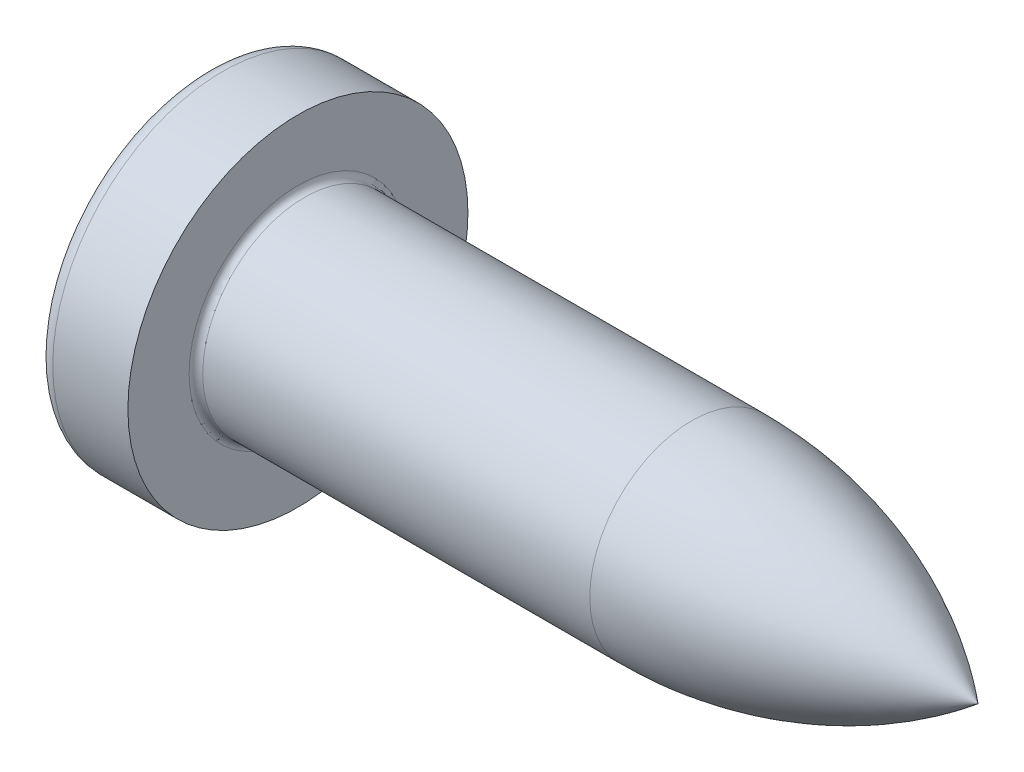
ISO-10303-21;
HEADER;
FILE_DESCRIPTION(('STEP AP214'),'2;1');
FILE_NAME('part.step','',(''),(''),'','','');
FILE_SCHEMA(('AUTOMOTIVE_DESIGN { 1 0 10303 214 1 1 1 1 }'));
ENDSEC;
DATA;
#1=APPLICATION_CONTEXT('core data for automotive mechanical design processes');
#2=APPLICATION_PROTOCOL_DEFINITION('international standard','automotive_design',2000,#1);
#3=PRODUCT_CONTEXT('',#1,'mechanical');
#4=PRODUCT('Part','Part','',(#3));
#5=PRODUCT_RELATED_PRODUCT_CATEGORY('part','',(#4));
#6=PRODUCT_DEFINITION_FORMATION('','',#4);
#7=PRODUCT_DEFINITION_CONTEXT('part definition',#1,'design');
#8=PRODUCT_DEFINITION('design','',#6,#7);
#9=PRODUCT_DEFINITION_SHAPE('','',#8);
#10=(LENGTH_UNIT() NAMED_UNIT(*) SI_UNIT(.MILLI.,.METRE.));
#11=(NAMED_UNIT(*) PLANE_ANGLE_UNIT() SI_UNIT($,.RADIAN.));
#12=(NAMED_UNIT(*) SI_UNIT($,.STERADIAN.) SOLID_ANGLE_UNIT());
#13=UNCERTAINTY_MEASURE_WITH_UNIT(LENGTH_MEASURE(1.E-05),#10,'distance_accuracy_value','');
#14=(GEOMETRIC_REPRESENTATION_CONTEXT(3) GLOBAL_UNCERTAINTY_ASSIGNED_CONTEXT((#13)) GLOBAL_UNIT_ASSIGNED_CONTEXT((#10,
#11,#12)) REPRESENTATION_CONTEXT('',''));
#15=CARTESIAN_POINT('',(0.,0.,0.));
#16=DIRECTION('',(0.,0.,1.));
#17=DIRECTION('',(1.,0.,0.));
#18=AXIS2_PLACEMENT_3D('',#15,#16,#17);
#19=CARTESIAN_POINT('',(4.,0.,0.));
#20=DIRECTION('',(-1.,0.,0.));
#21=DIRECTION('',(0.,1.,0.));
#22=AXIS2_PLACEMENT_3D('',#19,#20,#21);
#23=SPHERICAL_SURFACE('',#22,4.);
#24=CARTESIAN_POINT('',(0.803195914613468,0.,0.));
#25=DIRECTION('',(-1.,0.,0.));
#26=DIRECTION('',(0.,0.,1.));
#27=AXIS2_PLACEMENT_3D('',#24,#25,#26);
#28=CIRCLE('',#27,2.40425531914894);
#29=CARTESIAN_POINT('',(0.803195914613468,0.,2.40425531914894));
#30=VERTEX_POINT('',#29);
#31=EDGE_CURVE('E230',#30,#30,#28,.T.);
#32=ORIENTED_EDGE('',*,*,#31,.T.);
#33=EDGE_LOOP('',(#32));
#34=FACE_BOUND('',#33,.T.);
#35=CARTESIAN_POINT('',(0.0543400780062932,0.,0.));
#36=DIRECTION('',(1.,0.,0.));
#37=DIRECTION('',(0.,0.,-1.));
#38=AXIS2_PLACEMENT_3D('',#35,#36,#37);
#39=CIRCLE('',#38,0.657090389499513);
#40=CARTESIAN_POINT('',(0.0543400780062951,-0.369999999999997,-0.54301729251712));
#41=VERTEX_POINT('',#40);
#42=CARTESIAN_POINT('',(0.0543400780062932,-0.543017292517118,-0.37));
#43=VERTEX_POINT('',#42);
#44=EDGE_CURVE('E446',#41,#43,#39,.F.);
#45=ORIENTED_EDGE('',*,*,#44,.F.);
#46=CARTESIAN_POINT('',(4.,-0.37,0.));
#47=DIRECTION('',(0.,1.,0.));
#48=DIRECTION('',(0.,0.,1.));
#49=AXIS2_PLACEMENT_3D('',#46,#47,#48);
#50=CIRCLE('',#49,3.98285073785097);
#51=CARTESIAN_POINT('',(0.201999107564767,-0.369999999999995,-1.19928696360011));
#52=VERTEX_POINT('',#51);
#53=EDGE_CURVE('E277',#52,#41,#50,.T.);
#54=ORIENTED_EDGE('',*,*,#53,.F.);
#55=CARTESIAN_POINT('',(3.72274316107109,0.,0.556091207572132));
#56=DIRECTION('',(0.446197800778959,0.,-0.89493436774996));
#57=DIRECTION('',(-0.89493436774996,0.,-0.446197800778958));
#58=AXIS2_PLACEMENT_3D('',#55,#56,#57);
#59=CIRCLE('',#58,3.95144166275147);
#60=CARTESIAN_POINT('',(0.20199910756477,0.370000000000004,-1.19928696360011));
#61=VERTEX_POINT('',#60);
#62=EDGE_CURVE('E249',#52,#61,#59,.T.);
#63=ORIENTED_EDGE('',*,*,#62,.T.);
#64=CARTESIAN_POINT('',(4.,0.37,0.));
#65=DIRECTION('',(0.,-1.,0.));
#66=DIRECTION('',(0.,0.,-1.));
#67=AXIS2_PLACEMENT_3D('',#64,#65,#66);
#68=CIRCLE('',#67,3.98285073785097);
#69=CARTESIAN_POINT('',(0.0543400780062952,0.370000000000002,-0.543017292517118));
#70=VERTEX_POINT('',#69);
#71=EDGE_CURVE('E285',#70,#61,#68,.T.);
#72=ORIENTED_EDGE('',*,*,#71,.F.);
#73=CARTESIAN_POINT('',(0.0543400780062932,0.543017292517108,-0.37));
#74=VERTEX_POINT('',#73);
#75=EDGE_CURVE('E359',#74,#70,#39,.F.);
#76=ORIENTED_EDGE('',*,*,#75,.F.);
#77=CARTESIAN_POINT('',(4.,0.,-0.37));
#78=DIRECTION('',(0.,0.,1.));
#79=DIRECTION('',(0.,-1.,0.));
#80=AXIS2_PLACEMENT_3D('',#77,#78,#79);
#81=CIRCLE('',#80,3.98285073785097);
#82=CARTESIAN_POINT('',(0.201999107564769,1.19928696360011,-0.37));
#83=VERTEX_POINT('',#82);
#84=EDGE_CURVE('E243',#83,#74,#81,.T.);
#85=ORIENTED_EDGE('',*,*,#84,.F.);
#86=CARTESIAN_POINT('',(3.72274316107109,-0.556091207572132,0.));
#87=DIRECTION('',(0.446197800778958,0.89493436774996,0.));
#88=DIRECTION('',(-0.89493436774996,0.446197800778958,0.));
#89=AXIS2_PLACEMENT_3D('',#86,#87,#88);
#90=CIRCLE('',#89,3.95144166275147);
#91=CARTESIAN_POINT('',(0.201999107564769,1.19928696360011,0.369999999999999));
#92=VERTEX_POINT('',#91);
#93=EDGE_CURVE('E246',#83,#92,#90,.T.);
#94=ORIENTED_EDGE('',*,*,#93,.T.);
#95=CARTESIAN_POINT('',(4.,0.,0.37));
#96=DIRECTION('',(0.,0.,-1.));
#97=DIRECTION('',(0.,1.,0.));
#98=AXIS2_PLACEMENT_3D('',#95,#96,#97);
#99=CIRCLE('',#98,3.98285073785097);
#100=CARTESIAN_POINT('',(0.0543400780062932,0.543017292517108,0.37));
#101=VERTEX_POINT('',#100);
#102=EDGE_CURVE('E239',#101,#92,#99,.T.);
#103=ORIENTED_EDGE('',*,*,#102,.F.);
#104=CARTESIAN_POINT('',(0.0543400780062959,0.369999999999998,0.54301729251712));
#105=VERTEX_POINT('',#104);
#106=EDGE_CURVE('E392',#105,#101,#39,.F.);
#107=ORIENTED_EDGE('',*,*,#106,.F.);
#108=CARTESIAN_POINT('',(0.201999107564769,0.369999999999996,1.19928696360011));
#109=VERTEX_POINT('',#108);
#110=EDGE_CURVE('E259',#109,#105,#68,.T.);
#111=ORIENTED_EDGE('',*,*,#110,.F.);
#112=CARTESIAN_POINT('',(3.72274316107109,0.,-0.556091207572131));
#113=DIRECTION('',(0.446197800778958,0.,0.89493436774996));
#114=DIRECTION('',(0.89493436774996,0.,-0.446197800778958));
#115=AXIS2_PLACEMENT_3D('',#112,#113,#114);
#116=CIRCLE('',#115,3.95144166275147);
#117=CARTESIAN_POINT('',(0.201999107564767,-0.370000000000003,1.19928696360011));
#118=VERTEX_POINT('',#117);
#119=EDGE_CURVE('E39',#109,#118,#116,.T.);
#120=ORIENTED_EDGE('',*,*,#119,.T.);
#121=CARTESIAN_POINT('',(0.0543400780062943,-0.370000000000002,0.543017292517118));
#122=VERTEX_POINT('',#121);
#123=EDGE_CURVE('E256',#122,#118,#50,.T.);
#124=ORIENTED_EDGE('',*,*,#123,.F.);
#125=CARTESIAN_POINT('',(0.0543400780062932,-0.543017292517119,0.369999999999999));
#126=VERTEX_POINT('',#125);
#127=EDGE_CURVE('E431',#126,#122,#39,.F.);
#128=ORIENTED_EDGE('',*,*,#127,.F.);
#129=CARTESIAN_POINT('',(0.201999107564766,-1.19928696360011,0.369999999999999));
#130=VERTEX_POINT('',#129);
#131=EDGE_CURVE('E240',#130,#126,#99,.T.);
#132=ORIENTED_EDGE('',*,*,#131,.F.);
#133=CARTESIAN_POINT('',(3.72274316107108,0.556091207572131,0.));
#134=DIRECTION('',(0.446197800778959,-0.89493436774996,0.));
#135=DIRECTION('',(0.89493436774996,0.446197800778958,0.));
#136=AXIS2_PLACEMENT_3D('',#133,#134,#135);
#137=CIRCLE('',#136,3.95144166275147);
#138=CARTESIAN_POINT('',(0.201999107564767,-1.19928696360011,-0.37));
#139=VERTEX_POINT('',#138);
#140=EDGE_CURVE('E236',#130,#139,#137,.T.);
#141=ORIENTED_EDGE('',*,*,#140,.T.);
#142=EDGE_CURVE('E54',#43,#139,#81,.T.);
#143=ORIENTED_EDGE('',*,*,#142,.F.);
#144=EDGE_LOOP('',(#45,#54,#63,#72,#76,#85,#94,#103,#107,#111,#120,#124,#128,#132,#141,#143));
#145=FACE_BOUND('',#144,.T.);
#146=ADVANCED_FACE('F26',(#34,#145),#23,.T.);
#147=CARTESIAN_POINT('',(1.5,0.552127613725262,-0.37));
#148=DIRECTION('',(0.,0.,1.));
#149=DIRECTION('',(0.,-1.,0.));
#150=AXIS2_PLACEMENT_3D('',#147,#148,#149);
#151=PLANE('',#150);
#152=ORIENTED_EDGE('',*,*,#84,.T.);
#153=CARTESIAN_POINT('',(-0.984107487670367,0.628943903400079,-0.37));
#154=CARTESIAN_POINT('',(-0.783603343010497,0.61266994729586,-0.37));
#155=CARTESIAN_POINT('',(-0.583110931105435,0.596248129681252,-0.37));
#156=CARTESIAN_POINT('',(-0.182155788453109,0.562989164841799,-0.37));
#157=CARTESIAN_POINT('',(0.018306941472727,0.546152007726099,-0.37));
#158=CARTESIAN_POINT('',(0.419186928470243,0.511943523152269,-0.37));
#159=CARTESIAN_POINT('',(0.619604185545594,0.494572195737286,-0.37));
#160=CARTESIAN_POINT('',(1.02037173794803,0.459102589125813,-0.37));
#161=CARTESIAN_POINT('',(1.2207220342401,0.441004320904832,-0.37));
#162=CARTESIAN_POINT('',(1.53631168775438,0.411665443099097,-0.37));
#163=CARTESIAN_POINT('',(1.65158348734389,0.400774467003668,-0.37));
#164=CARTESIAN_POINT('',(1.88208360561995,0.378547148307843,-0.37));
#165=CARTESIAN_POINT('',(1.99731192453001,0.367210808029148,-0.37));
#166=CARTESIAN_POINT('',(2.22771614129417,0.343963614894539,-0.37));
#167=CARTESIAN_POINT('',(2.34289203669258,0.332052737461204,-0.37));
#168=CARTESIAN_POINT('',(2.57315819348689,0.307413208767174,-0.37));
#169=CARTESIAN_POINT('',(2.68824845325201,0.294684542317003,-0.37));
#170=CARTESIAN_POINT('',(2.80327961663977,0.281425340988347,-0.37));
#171=B_SPLINE_CURVE_WITH_KNOTS('',3,(#153,#154,#155,#156,#157,#158,#159,#160,#161,#162,#163,
#164,#165,#166,#167,#168,#169,#170),.UNSPECIFIED.,.F.,.F.,(4,2,2,2,2,2,2,2,4),(0.,
0.603490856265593,1.20699609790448,1.81050129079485,2.41399737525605,2.76135214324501,
3.1087051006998,3.45607293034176,3.80344721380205),.UNSPECIFIED.);
#172=CARTESIAN_POINT('',(1.5,0.415013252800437,-0.370000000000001));
#173=VERTEX_POINT('',#172);
#174=EDGE_CURVE('E352',#74,#173,#171,.T.);
#175=ORIENTED_EDGE('',*,*,#174,.T.);
#176=DIRECTION('',(0.,1.,0.));
#177=VECTOR('',#176,1.);
#178=CARTESIAN_POINT('',(1.5,-0.552127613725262,-0.37));
#179=LINE('',#178,#177);
#180=CARTESIAN_POINT('',(1.5,0.552127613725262,-0.37));
#181=VERTEX_POINT('',#180);
#182=EDGE_CURVE('E302',#173,#181,#179,.T.);
#183=ORIENTED_EDGE('',*,*,#182,.T.);
#184=DIRECTION('',(0.89493436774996,-0.446197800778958,0.));
#185=VECTOR('',#184,1.);
#186=CARTESIAN_POINT('',(0.,1.3,-0.37));
#187=LINE('',#186,#185);
#188=EDGE_CURVE('E308',#83,#181,#187,.T.);
#189=ORIENTED_EDGE('',*,*,#188,.F.);
#190=EDGE_LOOP('',(#152,#175,#183,#189));
#191=FACE_BOUND('',#190,.T.);
#192=ADVANCED_FACE('F187',(#191),#151,.T.);
#193=CARTESIAN_POINT('',(1.5,-0.552127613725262,-0.37));
#194=VERTEX_POINT('',#193);
#195=CARTESIAN_POINT('',(1.5,-0.415013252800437,-0.370000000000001));
#196=VERTEX_POINT('',#195);
#197=EDGE_CURVE('E299',#194,#196,#179,.T.);
#198=ORIENTED_EDGE('',*,*,#197,.T.);
#199=CARTESIAN_POINT('',(-0.984107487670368,-0.62894390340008,-0.37));
#200=CARTESIAN_POINT('',(-0.783603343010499,-0.61266994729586,-0.37));
#201=CARTESIAN_POINT('',(-0.583110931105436,-0.596248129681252,-0.37));
#202=CARTESIAN_POINT('',(-0.18215578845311,-0.562989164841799,-0.37));
#203=CARTESIAN_POINT('',(0.0183069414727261,-0.546152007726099,-0.37));
#204=CARTESIAN_POINT('',(0.419186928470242,-0.511943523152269,-0.37));
#205=CARTESIAN_POINT('',(0.619604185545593,-0.494572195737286,-0.37));
#206=CARTESIAN_POINT('',(1.02037173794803,-0.459102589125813,-0.37));
#207=CARTESIAN_POINT('',(1.22072203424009,-0.441004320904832,-0.37));
#208=CARTESIAN_POINT('',(1.53631168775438,-0.411665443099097,-0.37));
#209=CARTESIAN_POINT('',(1.65158348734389,-0.400774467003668,-0.37));
#210=CARTESIAN_POINT('',(1.88208360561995,-0.378547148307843,-0.37));
#211=CARTESIAN_POINT('',(1.99731192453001,-0.367210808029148,-0.37));
#212=CARTESIAN_POINT('',(2.22771614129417,-0.343963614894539,-0.37));
#213=CARTESIAN_POINT('',(2.34289203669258,-0.332052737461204,-0.37));
#214=CARTESIAN_POINT('',(2.57315819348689,-0.307413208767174,-0.37));
#215=CARTESIAN_POINT('',(2.68824845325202,-0.294684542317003,-0.37));
#216=CARTESIAN_POINT('',(2.80327961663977,-0.281425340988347,-0.37));
#217=B_SPLINE_CURVE_WITH_KNOTS('',3,(#199,#200,#201,#202,#203,#204,#205,#206,#207,#208,#209,
#210,#211,#212,#213,#214,#215,#216),.UNSPECIFIED.,.F.,.F.,(4,2,2,2,2,2,2,2,4),(0.,
0.603490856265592,1.20699609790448,1.81050129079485,2.41399737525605,2.76135214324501,
3.1087051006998,3.45607293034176,3.80344721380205),.UNSPECIFIED.);
#218=EDGE_CURVE('E345',#196,#43,#217,.F.);
#219=ORIENTED_EDGE('',*,*,#218,.T.);
#220=ORIENTED_EDGE('',*,*,#142,.T.);
#221=DIRECTION('',(0.89493436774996,0.446197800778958,0.));
#222=VECTOR('',#221,1.);
#223=CARTESIAN_POINT('',(0.,-1.3,-0.37));
#224=LINE('',#223,#222);
#225=EDGE_CURVE('E305',#139,#194,#224,.T.);
#226=ORIENTED_EDGE('',*,*,#225,.T.);
#227=EDGE_LOOP('',(#198,#219,#220,#226));
#228=FACE_BOUND('',#227,.T.);
#229=ADVANCED_FACE('F194',(#228),#151,.T.);
#230=CARTESIAN_POINT('',(1.5,-0.552127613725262,0.369999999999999));
#231=DIRECTION('',(0.,0.,-1.));
#232=DIRECTION('',(0.,1.,0.));
#233=AXIS2_PLACEMENT_3D('',#230,#231,#232);
#234=PLANE('',#233);
#235=DIRECTION('',(0.,-1.,0.));
#236=VECTOR('',#235,1.);
#237=CARTESIAN_POINT('',(1.5,0.552127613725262,0.37));
#238=LINE('',#237,#236);
#239=CARTESIAN_POINT('',(1.5,0.552127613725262,0.37));
#240=VERTEX_POINT('',#239);
#241=CARTESIAN_POINT('',(1.5,0.415013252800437,0.370000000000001));
#242=VERTEX_POINT('',#241);
#243=EDGE_CURVE('E291',#240,#242,#238,.T.);
#244=ORIENTED_EDGE('',*,*,#243,.T.);
#245=CARTESIAN_POINT('',(-0.984107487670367,0.62894390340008,0.37));
#246=CARTESIAN_POINT('',(-0.783603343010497,0.61266994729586,0.37));
#247=CARTESIAN_POINT('',(-0.583110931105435,0.596248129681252,0.37));
#248=CARTESIAN_POINT('',(-0.182155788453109,0.562989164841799,0.37));
#249=CARTESIAN_POINT('',(0.0183069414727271,0.546152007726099,0.37));
#250=CARTESIAN_POINT('',(0.419186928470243,0.511943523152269,0.37));
#251=CARTESIAN_POINT('',(0.619604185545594,0.494572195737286,0.37));
#252=CARTESIAN_POINT('',(1.02037173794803,0.459102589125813,0.37));
#253=CARTESIAN_POINT('',(1.2207220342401,0.441004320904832,0.37));
#254=CARTESIAN_POINT('',(1.53631168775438,0.411665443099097,0.37));
#255=CARTESIAN_POINT('',(1.65158348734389,0.400774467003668,0.37));
#256=CARTESIAN_POINT('',(1.88208360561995,0.378547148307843,0.37));
#257=CARTESIAN_POINT('',(1.99731192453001,0.367210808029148,0.37));
#258=CARTESIAN_POINT('',(2.22771614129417,0.343963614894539,0.37));
#259=CARTESIAN_POINT('',(2.34289203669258,0.332052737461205,0.37));
#260=CARTESIAN_POINT('',(2.57315819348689,0.307413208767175,0.37));
#261=CARTESIAN_POINT('',(2.68824845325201,0.294684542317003,0.37));
#262=CARTESIAN_POINT('',(2.80327961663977,0.281425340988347,0.37));
#263=B_SPLINE_CURVE_WITH_KNOTS('',3,(#245,#246,#247,#248,#249,#250,#251,#252,#253,#254,#255,
#256,#257,#258,#259,#260,#261,#262),.UNSPECIFIED.,.F.,.F.,(4,2,2,2,2,2,2,2,4),(0.,
0.603490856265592,1.20699609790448,1.81050129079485,2.41399737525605,2.76135214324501,
3.1087051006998,3.45607293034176,3.80344721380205),.UNSPECIFIED.);
#264=EDGE_CURVE('E393',#242,#101,#263,.F.);
#265=ORIENTED_EDGE('',*,*,#264,.T.);
#266=ORIENTED_EDGE('',*,*,#102,.T.);
#267=DIRECTION('',(0.89493436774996,-0.446197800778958,0.));
#268=VECTOR('',#267,1.);
#269=CARTESIAN_POINT('',(0.,1.3,0.37));
#270=LINE('',#269,#268);
#271=EDGE_CURVE('E307',#92,#240,#270,.T.);
#272=ORIENTED_EDGE('',*,*,#271,.T.);
#273=EDGE_LOOP('',(#244,#265,#266,#272));
#274=FACE_BOUND('',#273,.T.);
#275=ADVANCED_FACE('F340',(#274),#234,.T.);
#276=ORIENTED_EDGE('',*,*,#131,.T.);
#277=CARTESIAN_POINT('',(-0.984107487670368,-0.62894390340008,0.369999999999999));
#278=CARTESIAN_POINT('',(-0.783603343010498,-0.612669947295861,0.369999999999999));
#279=CARTESIAN_POINT('',(-0.583110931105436,-0.596248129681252,0.369999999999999));
#280=CARTESIAN_POINT('',(-0.18215578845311,-0.562989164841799,0.369999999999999));
#281=CARTESIAN_POINT('',(0.0183069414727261,-0.5461520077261,0.369999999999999));
#282=CARTESIAN_POINT('',(0.419186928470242,-0.511943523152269,0.369999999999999));
#283=CARTESIAN_POINT('',(0.619604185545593,-0.494572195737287,0.369999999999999));
#284=CARTESIAN_POINT('',(1.02037173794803,-0.459102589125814,0.369999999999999));
#285=CARTESIAN_POINT('',(1.22072203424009,-0.441004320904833,0.369999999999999));
#286=CARTESIAN_POINT('',(1.53631168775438,-0.411665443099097,0.369999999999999));
#287=CARTESIAN_POINT('',(1.65158348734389,-0.400774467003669,0.37));
#288=CARTESIAN_POINT('',(1.88208360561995,-0.378547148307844,0.37));
#289=CARTESIAN_POINT('',(1.99731192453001,-0.367210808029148,0.37));
#290=CARTESIAN_POINT('',(2.22771614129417,-0.34396361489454,0.37));
#291=CARTESIAN_POINT('',(2.34289203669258,-0.332052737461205,0.37));
#292=CARTESIAN_POINT('',(2.57315819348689,-0.307413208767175,0.37));
#293=CARTESIAN_POINT('',(2.68824845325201,-0.294684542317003,0.37));
#294=CARTESIAN_POINT('',(2.80327961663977,-0.281425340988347,0.37));
#295=B_SPLINE_CURVE_WITH_KNOTS('',3,(#277,#278,#279,#280,#281,#282,#283,#284,#285,#286,#287,
#288,#289,#290,#291,#292,#293,#294),.UNSPECIFIED.,.F.,.F.,(4,2,2,2,2,2,2,2,4),(0.,
0.603490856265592,1.20699609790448,1.81050129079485,2.41399737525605,2.76135214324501,
3.1087051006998,3.45607293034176,3.80344721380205),.UNSPECIFIED.);
#296=CARTESIAN_POINT('',(1.5,-0.415013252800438,0.37));
#297=VERTEX_POINT('',#296);
#298=EDGE_CURVE('E383',#126,#297,#295,.T.);
#299=ORIENTED_EDGE('',*,*,#298,.T.);
#300=CARTESIAN_POINT('',(1.5,-0.552127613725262,0.369999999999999));
#301=VERTEX_POINT('',#300);
#302=EDGE_CURVE('E294',#297,#301,#238,.T.);
#303=ORIENTED_EDGE('',*,*,#302,.T.);
#304=DIRECTION('',(0.89493436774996,0.446197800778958,0.));
#305=VECTOR('',#304,1.);
#306=CARTESIAN_POINT('',(0.,-1.3,0.369999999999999));
#307=LINE('',#306,#305);
#308=EDGE_CURVE('E289',#130,#301,#307,.T.);
#309=ORIENTED_EDGE('',*,*,#308,.F.);
#310=EDGE_LOOP('',(#276,#299,#303,#309));
#311=FACE_BOUND('',#310,.T.);
#312=ADVANCED_FACE('F336',(#311),#234,.T.);
#313=CARTESIAN_POINT('',(1.5,0.552127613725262,0.37));
#314=DIRECTION('',(0.446197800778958,0.89493436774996,0.));
#315=DIRECTION('',(-0.89493436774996,0.446197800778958,0.));
#316=AXIS2_PLACEMENT_3D('',#313,#314,#315);
#317=PLANE('',#316);
#318=CARTESIAN_POINT('',(2.47007520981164,0.0684659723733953,0.));
#319=DIRECTION('',(0.446197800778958,0.89493436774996,0.));
#320=DIRECTION('',(-0.89493436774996,0.446197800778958,0.));
#321=AXIS2_PLACEMENT_3D('',#318,#319,#320);
#322=ELLIPSE('',#321,1.09405678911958,0.483340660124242);
#323=CARTESIAN_POINT('',(1.5,0.552127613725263,0.0655064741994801));
#324=VERTEX_POINT('',#323);
#325=CARTESIAN_POINT('',(1.5,0.552127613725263,-0.0655064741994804));
#326=VERTEX_POINT('',#325);
#327=EDGE_CURVE('E423',#324,#326,#322,.F.);
#328=ORIENTED_EDGE('',*,*,#327,.F.);
#329=DIRECTION('',(0.,0.,-1.));
#330=VECTOR('',#329,1.);
#331=CARTESIAN_POINT('',(1.5,0.552127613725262,0.37));
#332=LINE('',#331,#330);
#333=EDGE_CURVE('E295',#240,#324,#332,.T.);
#334=ORIENTED_EDGE('',*,*,#333,.F.);
#335=ORIENTED_EDGE('',*,*,#271,.F.);
#336=ORIENTED_EDGE('',*,*,#93,.F.);
#337=ORIENTED_EDGE('',*,*,#188,.T.);
#338=EDGE_CURVE('E298',#326,#181,#332,.T.);
#339=ORIENTED_EDGE('',*,*,#338,.F.);
#340=EDGE_LOOP('',(#328,#334,#335,#336,#337,#339));
#341=FACE_BOUND('',#340,.T.);
#342=ADVANCED_FACE('F333',(#341),#317,.F.);
#343=CARTESIAN_POINT('',(0.,-1.3,-0.37));
#344=DIRECTION('',(0.446197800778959,-0.89493436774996,0.));
#345=DIRECTION('',(0.89493436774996,0.446197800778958,0.));
#346=AXIS2_PLACEMENT_3D('',#343,#344,#345);
#347=PLANE('',#346);
#348=CARTESIAN_POINT('',(2.47007520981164,-0.0684659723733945,0.));
#349=DIRECTION('',(0.446197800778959,-0.89493436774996,0.));
#350=DIRECTION('',(-0.89493436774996,-0.446197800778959,0.));
#351=AXIS2_PLACEMENT_3D('',#348,#349,#350);
#352=ELLIPSE('',#351,1.09405678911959,0.483340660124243);
#353=CARTESIAN_POINT('',(1.5,-0.552127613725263,-0.0655064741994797));
#354=VERTEX_POINT('',#353);
#355=CARTESIAN_POINT('',(1.5,-0.552127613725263,0.0655064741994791));
#356=VERTEX_POINT('',#355);
#357=EDGE_CURVE('E419',#354,#356,#352,.F.);
#358=ORIENTED_EDGE('',*,*,#357,.F.);
#359=DIRECTION('',(0.,0.,1.));
#360=VECTOR('',#359,1.);
#361=CARTESIAN_POINT('',(1.5,-0.552127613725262,-0.37));
#362=LINE('',#361,#360);
#363=EDGE_CURVE('E286',#194,#354,#362,.T.);
#364=ORIENTED_EDGE('',*,*,#363,.F.);
#365=ORIENTED_EDGE('',*,*,#225,.F.);
#366=ORIENTED_EDGE('',*,*,#140,.F.);
#367=ORIENTED_EDGE('',*,*,#308,.T.);
#368=EDGE_CURVE('E290',#356,#301,#362,.T.);
#369=ORIENTED_EDGE('',*,*,#368,.F.);
#370=EDGE_LOOP('',(#358,#364,#365,#366,#367,#369));
#371=FACE_BOUND('',#370,.T.);
#372=ADVANCED_FACE('F335',(#371),#347,.F.);
#373=CARTESIAN_POINT('',(1.5,0.552127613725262,-0.37));
#374=DIRECTION('',(-1.,0.,0.));
#375=DIRECTION('',(0.,0.,1.));
#376=AXIS2_PLACEMENT_3D('',#373,#374,#375);
#377=PLANE('',#376);
#378=DIRECTION('',(0.,1.,0.));
#379=VECTOR('',#378,1.);
#380=CARTESIAN_POINT('',(1.5,-0.370000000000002,0.55212761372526));
#381=LINE('',#380,#379);
#382=CARTESIAN_POINT('',(1.5,-0.370000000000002,0.55212761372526));
#383=VERTEX_POINT('',#382);
#384=CARTESIAN_POINT('',(1.5,-0.0655064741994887,0.552127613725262));
#385=VERTEX_POINT('',#384);
#386=EDGE_CURVE('E487',#383,#385,#381,.T.);
#387=ORIENTED_EDGE('',*,*,#386,.T.);
#388=CARTESIAN_POINT('',(1.5,0.,0.));
#389=DIRECTION('',(-1.,0.,0.));
#390=DIRECTION('',(0.,0.,1.));
#391=AXIS2_PLACEMENT_3D('',#388,#389,#390);
#392=CIRCLE('',#391,0.556);
#393=CARTESIAN_POINT('',(1.5,-0.370000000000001,0.415013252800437));
#394=VERTEX_POINT('',#393);
#395=EDGE_CURVE('E444',#394,#385,#392,.T.);
#396=ORIENTED_EDGE('',*,*,#395,.F.);
#397=DIRECTION('',(0.,0.,-1.));
#398=VECTOR('',#397,1.);
#399=CARTESIAN_POINT('',(1.5,-0.370000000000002,0.55212761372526));
#400=LINE('',#399,#398);
#401=EDGE_CURVE('E482',#383,#394,#400,.T.);
#402=ORIENTED_EDGE('',*,*,#401,.F.);
#403=EDGE_LOOP('',(#387,#396,#402));
#404=FACE_BOUND('',#403,.T.);
#405=ADVANCED_FACE('F408',(#404),#377,.T.);
#406=ORIENTED_EDGE('',*,*,#302,.F.);
#407=EDGE_CURVE('E439',#356,#297,#392,.T.);
#408=ORIENTED_EDGE('',*,*,#407,.F.);
#409=ORIENTED_EDGE('',*,*,#368,.T.);
#410=EDGE_LOOP('',(#406,#408,#409));
#411=FACE_BOUND('',#410,.T.);
#412=ADVANCED_FACE('F410',(#411),#377,.T.);
#413=ORIENTED_EDGE('',*,*,#363,.T.);
#414=EDGE_CURVE('E428',#196,#354,#392,.T.);
#415=ORIENTED_EDGE('',*,*,#414,.F.);
#416=ORIENTED_EDGE('',*,*,#197,.F.);
#417=EDGE_LOOP('',(#413,#415,#416));
#418=FACE_BOUND('',#417,.T.);
#419=ADVANCED_FACE('F426',(#418),#377,.T.);
#420=CARTESIAN_POINT('',(1.5,-0.369999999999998,-0.415013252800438));
#421=VERTEX_POINT('',#420);
#422=CARTESIAN_POINT('',(1.5,-0.369999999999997,-0.552127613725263));
#423=VERTEX_POINT('',#422);
#424=EDGE_CURVE('E476',#421,#423,#400,.T.);
#425=ORIENTED_EDGE('',*,*,#424,.F.);
#426=CARTESIAN_POINT('',(1.5,-0.0655064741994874,-0.552127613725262));
#427=VERTEX_POINT('',#426);
#428=EDGE_CURVE('E46',#427,#421,#392,.T.);
#429=ORIENTED_EDGE('',*,*,#428,.F.);
#430=DIRECTION('',(0.,-1.,0.));
#431=VECTOR('',#430,1.);
#432=CARTESIAN_POINT('',(1.5,0.370000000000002,-0.55212761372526));
#433=LINE('',#432,#431);
#434=EDGE_CURVE('E474',#427,#423,#433,.T.);
#435=ORIENTED_EDGE('',*,*,#434,.T.);
#436=EDGE_LOOP('',(#425,#429,#435));
#437=FACE_BOUND('',#436,.T.);
#438=ADVANCED_FACE('F473',(#437),#377,.T.);
#439=CARTESIAN_POINT('',(1.5,0.370000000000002,-0.55212761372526));
#440=VERTEX_POINT('',#439);
#441=CARTESIAN_POINT('',(1.5,0.0655064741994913,-0.552127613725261));
#442=VERTEX_POINT('',#441);
#443=EDGE_CURVE('E481',#440,#442,#433,.T.);
#444=ORIENTED_EDGE('',*,*,#443,.T.);
#445=CARTESIAN_POINT('',(1.5,0.370000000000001,-0.415013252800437));
#446=VERTEX_POINT('',#445);
#447=EDGE_CURVE('E470',#446,#442,#392,.T.);
#448=ORIENTED_EDGE('',*,*,#447,.F.);
#449=DIRECTION('',(0.,0.,1.));
#450=VECTOR('',#449,1.);
#451=CARTESIAN_POINT('',(1.5,0.370000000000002,-0.55212761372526));
#452=LINE('',#451,#450);
#453=EDGE_CURVE('E491',#440,#446,#452,.T.);
#454=ORIENTED_EDGE('',*,*,#453,.F.);
#455=EDGE_LOOP('',(#444,#448,#454));
#456=FACE_BOUND('',#455,.T.);
#457=ADVANCED_FACE('F498',(#456),#377,.T.);
#458=ORIENTED_EDGE('',*,*,#182,.F.);
#459=EDGE_CURVE('E500',#326,#173,#392,.T.);
#460=ORIENTED_EDGE('',*,*,#459,.F.);
#461=ORIENTED_EDGE('',*,*,#338,.T.);
#462=EDGE_LOOP('',(#458,#460,#461));
#463=FACE_BOUND('',#462,.T.);
#464=ADVANCED_FACE('F526',(#463),#377,.T.);
#465=ORIENTED_EDGE('',*,*,#333,.T.);
#466=EDGE_CURVE('E505',#242,#324,#392,.T.);
#467=ORIENTED_EDGE('',*,*,#466,.F.);
#468=ORIENTED_EDGE('',*,*,#243,.F.);
#469=EDGE_LOOP('',(#465,#467,#468));
#470=FACE_BOUND('',#469,.T.);
#471=ADVANCED_FACE('F514',(#470),#377,.T.);
#472=CARTESIAN_POINT('',(1.5,0.369999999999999,0.415013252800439));
#473=VERTEX_POINT('',#472);
#474=CARTESIAN_POINT('',(1.5,0.369999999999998,0.552127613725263));
#475=VERTEX_POINT('',#474);
#476=EDGE_CURVE('E274',#473,#475,#452,.T.);
#477=ORIENTED_EDGE('',*,*,#476,.F.);
#478=CARTESIAN_POINT('',(1.5,0.0655064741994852,0.552127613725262));
#479=VERTEX_POINT('',#478);
#480=EDGE_CURVE('E445',#479,#473,#392,.T.);
#481=ORIENTED_EDGE('',*,*,#480,.F.);
#482=EDGE_CURVE('E490',#479,#475,#381,.T.);
#483=ORIENTED_EDGE('',*,*,#482,.T.);
#484=EDGE_LOOP('',(#477,#481,#483));
#485=FACE_BOUND('',#484,.T.);
#486=ADVANCED_FACE('F402',(#485),#377,.T.);
#487=CARTESIAN_POINT('',(1.5,0.369999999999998,0.552127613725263));
#488=DIRECTION('',(0.,-1.,0.));
#489=DIRECTION('',(0.,0.,-1.));
#490=AXIS2_PLACEMENT_3D('',#487,#488,#489);
#491=PLANE('',#490);
#492=ORIENTED_EDGE('',*,*,#110,.T.);
#493=CARTESIAN_POINT('',(-0.984107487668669,0.369999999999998,0.628943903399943));
#494=CARTESIAN_POINT('',(-0.783603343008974,0.369999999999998,0.612669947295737));
#495=CARTESIAN_POINT('',(-0.583110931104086,0.369999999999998,0.596248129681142));
#496=CARTESIAN_POINT('',(-0.182155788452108,0.369999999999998,0.562989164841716));
#497=CARTESIAN_POINT('',(0.0183069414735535,0.369999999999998,0.546152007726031));
#498=CARTESIAN_POINT('',(0.419186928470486,0.369999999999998,0.511943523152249));
#499=CARTESIAN_POINT('',(0.61960418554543,0.369999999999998,0.494572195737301));
#500=CARTESIAN_POINT('',(1.02037173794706,0.369999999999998,0.459102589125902));
#501=CARTESIAN_POINT('',(1.22072203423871,0.369999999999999,0.441004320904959));
#502=CARTESIAN_POINT('',(1.53631168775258,0.369999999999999,0.411665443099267));
#503=CARTESIAN_POINT('',(1.65158348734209,0.369999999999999,0.40077446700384));
#504=CARTESIAN_POINT('',(1.88208360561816,0.369999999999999,0.378547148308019));
#505=CARTESIAN_POINT('',(1.99731192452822,0.369999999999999,0.367210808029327));
#506=CARTESIAN_POINT('',(2.22771614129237,0.369999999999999,0.343963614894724));
#507=CARTESIAN_POINT('',(2.34289203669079,0.369999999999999,0.332052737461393));
#508=CARTESIAN_POINT('',(2.5731581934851,0.369999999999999,0.307413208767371));
#509=CARTESIAN_POINT('',(2.68824845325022,0.369999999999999,0.294684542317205));
#510=CARTESIAN_POINT('',(2.80327961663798,0.369999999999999,0.281425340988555));
#511=B_SPLINE_CURVE_WITH_KNOTS('',3,(#493,#494,#495,#496,#497,#498,#499,#500,#501,#502,#503,
#504,#505,#506,#507,#508,#509,#510),.UNSPECIFIED.,.F.,.F.,(4,2,2,2,2,2,2,2,4),(0.,
0.603490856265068,1.20699609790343,1.81050129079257,2.41399737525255,2.7613521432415,
3.1087051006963,3.45607293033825,3.80344721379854),.UNSPECIFIED.);
#512=EDGE_CURVE('E388',#105,#473,#511,.T.);
#513=ORIENTED_EDGE('',*,*,#512,.T.);
#514=ORIENTED_EDGE('',*,*,#476,.T.);
#515=DIRECTION('',(0.89493436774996,0.,-0.446197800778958));
#516=VECTOR('',#515,1.);
#517=CARTESIAN_POINT('',(0.,0.369999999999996,1.3));
#518=LINE('',#517,#516);
#519=EDGE_CURVE('E267',#109,#475,#518,.T.);
#520=ORIENTED_EDGE('',*,*,#519,.F.);
#521=EDGE_LOOP('',(#492,#513,#514,#520));
#522=FACE_BOUND('',#521,.T.);
#523=ADVANCED_FACE('F271',(#522),#491,.T.);
#524=CARTESIAN_POINT('',(1.5,-0.369999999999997,-0.552127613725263));
#525=DIRECTION('',(0.,1.,0.));
#526=DIRECTION('',(0.,0.,1.));
#527=AXIS2_PLACEMENT_3D('',#524,#525,#526);
#528=PLANE('',#527);
#529=ORIENTED_EDGE('',*,*,#401,.T.);
#530=CARTESIAN_POINT('',(-0.984107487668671,-0.370000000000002,0.628943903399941));
#531=CARTESIAN_POINT('',(-0.783603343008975,-0.370000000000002,0.612669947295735));
#532=CARTESIAN_POINT('',(-0.583110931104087,-0.370000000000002,0.59624812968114));
#533=CARTESIAN_POINT('',(-0.18215578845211,-0.370000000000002,0.562989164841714));
#534=CARTESIAN_POINT('',(0.0183069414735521,-0.370000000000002,0.546152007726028));
#535=CARTESIAN_POINT('',(0.419186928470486,-0.370000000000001,0.511943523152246));
#536=CARTESIAN_POINT('',(0.619604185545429,-0.370000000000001,0.494572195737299));
#537=CARTESIAN_POINT('',(1.02037173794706,-0.370000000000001,0.459102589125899));
#538=CARTESIAN_POINT('',(1.22072203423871,-0.370000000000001,0.441004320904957));
#539=CARTESIAN_POINT('',(1.53631168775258,-0.370000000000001,0.411665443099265));
#540=CARTESIAN_POINT('',(1.65158348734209,-0.370000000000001,0.400774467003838));
#541=CARTESIAN_POINT('',(1.88208360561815,-0.370000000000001,0.378547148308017));
#542=CARTESIAN_POINT('',(1.99731192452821,-0.370000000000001,0.367210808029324));
#543=CARTESIAN_POINT('',(2.22771614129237,-0.370000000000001,0.343963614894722));
#544=CARTESIAN_POINT('',(2.34289203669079,-0.370000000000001,0.332052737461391));
#545=CARTESIAN_POINT('',(2.5731581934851,-0.370000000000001,0.307413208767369));
#546=CARTESIAN_POINT('',(2.68824845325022,-0.370000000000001,0.294684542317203));
#547=CARTESIAN_POINT('',(2.80327961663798,-0.370000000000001,0.281425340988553));
#548=B_SPLINE_CURVE_WITH_KNOTS('',3,(#530,#531,#532,#533,#534,#535,#536,#537,#538,#539,#540,
#541,#542,#543,#544,#545,#546,#547),.UNSPECIFIED.,.F.,.F.,(4,2,2,2,2,2,2,2,4),(0.,
0.603490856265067,1.20699609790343,1.81050129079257,2.41399737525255,2.7613521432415,
3.1087051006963,3.45607293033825,3.80344721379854),.UNSPECIFIED.);
#549=EDGE_CURVE('E378',#394,#122,#548,.F.);
#550=ORIENTED_EDGE('',*,*,#549,.T.);
#551=ORIENTED_EDGE('',*,*,#123,.T.);
#552=DIRECTION('',(0.89493436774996,0.,-0.446197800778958));
#553=VECTOR('',#552,1.);
#554=CARTESIAN_POINT('',(0.,-0.370000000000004,1.3));
#555=LINE('',#554,#553);
#556=EDGE_CURVE('E269',#118,#383,#555,.T.);
#557=ORIENTED_EDGE('',*,*,#556,.T.);
#558=EDGE_LOOP('',(#529,#550,#551,#557));
#559=FACE_BOUND('',#558,.T.);
#560=ADVANCED_FACE('F401',(#559),#528,.T.);
#561=CARTESIAN_POINT('',(1.5,-0.370000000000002,0.55212761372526));
#562=DIRECTION('',(0.446197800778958,0.,0.89493436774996));
#563=DIRECTION('',(-0.89493436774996,0.,0.446197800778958));
#564=AXIS2_PLACEMENT_3D('',#561,#562,#563);
#565=PLANE('',#564);
#566=CARTESIAN_POINT('',(2.47007520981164,0.,0.0684659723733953));
#567=DIRECTION('',(0.446197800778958,0.,0.89493436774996));
#568=DIRECTION('',(-0.89493436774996,0.,0.446197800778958));
#569=AXIS2_PLACEMENT_3D('',#566,#567,#568);
#570=ELLIPSE('',#569,1.09405678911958,0.483340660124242);
#571=EDGE_CURVE('E454',#385,#479,#570,.F.);
#572=ORIENTED_EDGE('',*,*,#571,.F.);
#573=ORIENTED_EDGE('',*,*,#386,.F.);
#574=ORIENTED_EDGE('',*,*,#556,.F.);
#575=ORIENTED_EDGE('',*,*,#119,.F.);
#576=ORIENTED_EDGE('',*,*,#519,.T.);
#577=ORIENTED_EDGE('',*,*,#482,.F.);
#578=EDGE_LOOP('',(#572,#573,#574,#575,#576,#577));
#579=FACE_BOUND('',#578,.T.);
#580=ADVANCED_FACE('F265',(#579),#565,.F.);
#581=CARTESIAN_POINT('',(0.,0.370000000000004,-1.3));
#582=DIRECTION('',(0.446197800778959,0.,-0.89493436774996));
#583=DIRECTION('',(0.89493436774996,0.,0.446197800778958));
#584=AXIS2_PLACEMENT_3D('',#581,#582,#583);
#585=PLANE('',#584);
#586=CARTESIAN_POINT('',(2.47007520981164,0.,-0.0684659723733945));
#587=DIRECTION('',(0.446197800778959,0.,-0.89493436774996));
#588=DIRECTION('',(-0.89493436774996,0.,-0.446197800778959));
#589=AXIS2_PLACEMENT_3D('',#586,#587,#588);
#590=ELLIPSE('',#589,1.09405678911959,0.483340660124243);
#591=EDGE_CURVE('E358',#442,#427,#590,.F.);
#592=ORIENTED_EDGE('',*,*,#591,.F.);
#593=ORIENTED_EDGE('',*,*,#443,.F.);
#594=DIRECTION('',(0.89493436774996,0.,0.446197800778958));
#595=VECTOR('',#594,1.);
#596=CARTESIAN_POINT('',(0.,0.370000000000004,-1.3));
#597=LINE('',#596,#595);
#598=EDGE_CURVE('E279',#61,#440,#597,.T.);
#599=ORIENTED_EDGE('',*,*,#598,.F.);
#600=ORIENTED_EDGE('',*,*,#62,.F.);
#601=DIRECTION('',(0.89493436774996,0.,0.446197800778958));
#602=VECTOR('',#601,1.);
#603=CARTESIAN_POINT('',(0.,-0.369999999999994,-1.3));
#604=LINE('',#603,#602);
#605=EDGE_CURVE('E480',#52,#423,#604,.T.);
#606=ORIENTED_EDGE('',*,*,#605,.T.);
#607=ORIENTED_EDGE('',*,*,#434,.F.);
#608=EDGE_LOOP('',(#592,#593,#599,#600,#606,#607));
#609=FACE_BOUND('',#608,.T.);
#610=ADVANCED_FACE('F368',(#609),#585,.F.);
#611=ORIENTED_EDGE('',*,*,#453,.T.);
#612=CARTESIAN_POINT('',(-0.98410748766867,0.370000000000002,-0.628943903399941));
#613=CARTESIAN_POINT('',(-0.783603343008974,0.370000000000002,-0.612669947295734));
#614=CARTESIAN_POINT('',(-0.583110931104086,0.370000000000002,-0.59624812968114));
#615=CARTESIAN_POINT('',(-0.182155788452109,0.370000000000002,-0.562989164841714));
#616=CARTESIAN_POINT('',(0.0183069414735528,0.370000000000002,-0.546152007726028));
#617=CARTESIAN_POINT('',(0.419186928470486,0.370000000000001,-0.511943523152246));
#618=CARTESIAN_POINT('',(0.61960418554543,0.370000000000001,-0.494572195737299));
#619=CARTESIAN_POINT('',(1.02037173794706,0.370000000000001,-0.459102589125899));
#620=CARTESIAN_POINT('',(1.22072203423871,0.370000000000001,-0.441004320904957));
#621=CARTESIAN_POINT('',(1.53631168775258,0.370000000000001,-0.411665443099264));
#622=CARTESIAN_POINT('',(1.65158348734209,0.370000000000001,-0.400774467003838));
#623=CARTESIAN_POINT('',(1.88208360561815,0.370000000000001,-0.378547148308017));
#624=CARTESIAN_POINT('',(1.99731192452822,0.370000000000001,-0.367210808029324));
#625=CARTESIAN_POINT('',(2.22771614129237,0.370000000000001,-0.343963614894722));
#626=CARTESIAN_POINT('',(2.34289203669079,0.370000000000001,-0.332052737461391));
#627=CARTESIAN_POINT('',(2.5731581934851,0.370000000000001,-0.307413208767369));
#628=CARTESIAN_POINT('',(2.68824845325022,0.370000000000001,-0.294684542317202));
#629=CARTESIAN_POINT('',(2.80327961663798,0.370000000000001,-0.281425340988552));
#630=B_SPLINE_CURVE_WITH_KNOTS('',3,(#612,#613,#614,#615,#616,#617,#618,#619,#620,#621,#622,
#623,#624,#625,#626,#627,#628,#629),.UNSPECIFIED.,.F.,.F.,(4,2,2,2,2,2,2,2,4),(0.,
0.603490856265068,1.20699609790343,1.81050129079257,2.41399737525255,2.7613521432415,
3.1087051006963,3.45607293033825,3.80344721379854),.UNSPECIFIED.);
#631=EDGE_CURVE('E360',#446,#70,#630,.F.);
#632=ORIENTED_EDGE('',*,*,#631,.T.);
#633=ORIENTED_EDGE('',*,*,#71,.T.);
#634=ORIENTED_EDGE('',*,*,#598,.T.);
#635=EDGE_LOOP('',(#611,#632,#633,#634));
#636=FACE_BOUND('',#635,.T.);
#637=ADVANCED_FACE('F403',(#636),#491,.T.);
#638=ORIENTED_EDGE('',*,*,#53,.T.);
#639=CARTESIAN_POINT('',(-0.98410748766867,-0.369999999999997,-0.628943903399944));
#640=CARTESIAN_POINT('',(-0.783603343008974,-0.369999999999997,-0.612669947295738));
#641=CARTESIAN_POINT('',(-0.583110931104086,-0.369999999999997,-0.596248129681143));
#642=CARTESIAN_POINT('',(-0.182155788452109,-0.369999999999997,-0.562989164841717));
#643=CARTESIAN_POINT('',(0.0183069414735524,-0.369999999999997,-0.546152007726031));
#644=CARTESIAN_POINT('',(0.419186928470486,-0.369999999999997,-0.511943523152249));
#645=CARTESIAN_POINT('',(0.619604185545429,-0.369999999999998,-0.494572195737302));
#646=CARTESIAN_POINT('',(1.02037173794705,-0.369999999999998,-0.459102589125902));
#647=CARTESIAN_POINT('',(1.22072203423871,-0.369999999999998,-0.44100432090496));
#648=CARTESIAN_POINT('',(1.53631168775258,-0.369999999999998,-0.411665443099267));
#649=CARTESIAN_POINT('',(1.65158348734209,-0.369999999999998,-0.400774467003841));
#650=CARTESIAN_POINT('',(1.88208360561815,-0.369999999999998,-0.37854714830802));
#651=CARTESIAN_POINT('',(1.99731192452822,-0.369999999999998,-0.367210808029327));
#652=CARTESIAN_POINT('',(2.22771614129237,-0.369999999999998,-0.343963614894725));
#653=CARTESIAN_POINT('',(2.34289203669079,-0.369999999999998,-0.332052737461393));
#654=CARTESIAN_POINT('',(2.5731581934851,-0.369999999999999,-0.307413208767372));
#655=CARTESIAN_POINT('',(2.68824845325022,-0.369999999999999,-0.294684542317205));
#656=CARTESIAN_POINT('',(2.80327961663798,-0.369999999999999,-0.281425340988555));
#657=B_SPLINE_CURVE_WITH_KNOTS('',3,(#639,#640,#641,#642,#643,#644,#645,#646,#647,#648,#649,
#650,#651,#652,#653,#654,#655,#656),.UNSPECIFIED.,.F.,.F.,(4,2,2,2,2,2,2,2,4),(0.,
0.603490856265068,1.20699609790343,1.81050129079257,2.41399737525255,2.7613521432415,
3.1087051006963,3.45607293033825,3.80344721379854),.UNSPECIFIED.);
#658=EDGE_CURVE('E11',#41,#421,#657,.T.);
#659=ORIENTED_EDGE('',*,*,#658,.T.);
#660=ORIENTED_EDGE('',*,*,#424,.T.);
#661=ORIENTED_EDGE('',*,*,#605,.F.);
#662=EDGE_LOOP('',(#638,#659,#660,#661));
#663=FACE_BOUND('',#662,.T.);
#664=ADVANCED_FACE('F216',(#663),#528,.T.);
#665=CARTESIAN_POINT('',(-25.4,0.,0.));
#666=DIRECTION('',(-1.,0.,0.));
#667=DIRECTION('',(0.,0.,1.));
#668=AXIS2_PLACEMENT_3D('',#665,#666,#667);
#669=CYLINDRICAL_SURFACE('',#668,1.5);
#670=CARTESIAN_POINT('',(2.2,0.,0.));
#671=DIRECTION('',(-1.,0.,0.));
#672=DIRECTION('',(0.,0.,1.));
#673=AXIS2_PLACEMENT_3D('',#670,#671,#672);
#674=CIRCLE('',#673,1.5);
#675=CARTESIAN_POINT('',(2.2,0.,1.5));
#676=VERTEX_POINT('',#675);
#677=EDGE_CURVE('E227',#676,#676,#674,.F.);
#678=ORIENTED_EDGE('',*,*,#677,.T.);
#679=EDGE_LOOP('',(#678));
#680=FACE_BOUND('',#679,.T.);
#681=CARTESIAN_POINT('',(7.89130777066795,0.,0.));
#682=DIRECTION('',(-1.,0.,0.));
#683=DIRECTION('',(0.,0.,1.));
#684=AXIS2_PLACEMENT_3D('',#681,#682,#683);
#685=CIRCLE('',#684,1.5);
#686=CARTESIAN_POINT('',(7.89130777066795,0.,1.5));
#687=VERTEX_POINT('',#686);
#688=EDGE_CURVE('E311',#687,#687,#685,.T.);
#689=ORIENTED_EDGE('',*,*,#688,.T.);
#690=EDGE_LOOP('',(#689));
#691=FACE_BOUND('',#690,.T.);
#692=ADVANCED_FACE('F28',(#680,#691),#669,.T.);
#693=CARTESIAN_POINT('',(2.1,1.5,0.));
#694=DIRECTION('',(-1.,0.,0.));
#695=DIRECTION('',(0.,0.,1.));
#696=AXIS2_PLACEMENT_3D('',#693,#694,#695);
#697=PLANE('',#696);
#698=CARTESIAN_POINT('',(2.1,0.,0.));
#699=DIRECTION('',(-1.,0.,0.));
#700=DIRECTION('',(0.,0.,1.));
#701=AXIS2_PLACEMENT_3D('',#698,#699,#700);
#702=CIRCLE('',#701,1.6);
#703=CARTESIAN_POINT('',(2.1,0.,1.6));
#704=VERTEX_POINT('',#703);
#705=EDGE_CURVE('E221',#704,#704,#702,.T.);
#706=ORIENTED_EDGE('',*,*,#705,.T.);
#707=EDGE_LOOP('',(#706));
#708=FACE_BOUND('',#707,.T.);
#709=CARTESIAN_POINT('',(2.1,0.,0.));
#710=DIRECTION('',(-1.,0.,0.));
#711=DIRECTION('',(0.,0.,1.));
#712=AXIS2_PLACEMENT_3D('',#709,#710,#711);
#713=CIRCLE('',#712,2.5);
#714=CARTESIAN_POINT('',(2.1,0.,2.5));
#715=VERTEX_POINT('',#714);
#716=EDGE_CURVE('E224',#715,#715,#713,.T.);
#717=ORIENTED_EDGE('',*,*,#716,.F.);
#718=EDGE_LOOP('',(#717));
#719=FACE_BOUND('',#718,.T.);
#720=ADVANCED_FACE('F209',(#708,#719),#697,.F.);
#721=CARTESIAN_POINT('',(-25.4,0.,0.));
#722=DIRECTION('',(-1.,0.,0.));
#723=DIRECTION('',(0.,0.,1.));
#724=AXIS2_PLACEMENT_3D('',#721,#722,#723);
#725=CYLINDRICAL_SURFACE('',#724,2.5);
#726=ORIENTED_EDGE('',*,*,#716,.T.);
#727=EDGE_LOOP('',(#726));
#728=FACE_BOUND('',#727,.T.);
#729=CARTESIAN_POINT('',(0.995004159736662,0.,0.));
#730=DIRECTION('',(-1.,0.,0.));
#731=DIRECTION('',(0.,0.,1.));
#732=AXIS2_PLACEMENT_3D('',#729,#730,#731);
#733=CIRCLE('',#732,2.5);
#734=CARTESIAN_POINT('',(0.995004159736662,0.,2.5));
#735=VERTEX_POINT('',#734);
#736=EDGE_CURVE('E225',#735,#735,#733,.T.);
#737=ORIENTED_EDGE('',*,*,#736,.F.);
#738=EDGE_LOOP('',(#737));
#739=FACE_BOUND('',#738,.T.);
#740=ADVANCED_FACE('F206',(#728,#739),#725,.T.);
#741=CARTESIAN_POINT('',(0.995004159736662,0.,0.));
#742=DIRECTION('',(-1.,0.,0.));
#743=DIRECTION('',(0.,0.,1.));
#744=AXIS2_PLACEMENT_3D('',#741,#742,#743);
#745=TOROIDAL_SURFACE('',#744,2.26,0.24);
#746=ORIENTED_EDGE('',*,*,#736,.T.);
#747=EDGE_LOOP('',(#746));
#748=FACE_BOUND('',#747,.T.);
#749=ORIENTED_EDGE('',*,*,#31,.F.);
#750=EDGE_LOOP('',(#749));
#751=FACE_BOUND('',#750,.T.);
#752=ADVANCED_FACE('F203',(#748,#751),#745,.T.);
#753=CARTESIAN_POINT('',(7.89130777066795,0.,-5.15436342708));
#754=DIRECTION('',(0.,-1.,0.));
#755=DIRECTION('',(0.,0.,1.));
#756=AXIS2_PLACEMENT_3D('',#753,#754,#755);
#757=CIRCLE('',#756,6.65436342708);
#758=TRIMMED_CURVE('',#757,(PARAMETER_VALUE(-0.684739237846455)),
(PARAMETER_VALUE(0.684739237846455)),.T.,.PARAMETER.);
#759=CARTESIAN_POINT('',(7.89130777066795,0.,0.));
#760=DIRECTION('',(-1.,0.,0.));
#761=AXIS1_PLACEMENT('',#759,#760);
#762=SURFACE_OF_REVOLUTION('',#758,#761);
#763=ORIENTED_EDGE('',*,*,#688,.F.);
#764=EDGE_LOOP('',(#763));
#765=FACE_BOUND('',#764,.T.);
#766=CARTESIAN_POINT('',(12.1,0.,0.));
#767=VERTEX_POINT('',#766);
#768=VERTEX_LOOP('',#767);
#769=FACE_BOUND('',#768,.T.);
#770=ADVANCED_FACE('F201',(#765,#769),#762,.T.);
#771=CARTESIAN_POINT('',(2.2,0.,0.));
#772=DIRECTION('',(-1.,0.,0.));
#773=DIRECTION('',(0.,0.,1.));
#774=AXIS2_PLACEMENT_3D('',#771,#772,#773);
#775=TOROIDAL_SURFACE('',#774,1.6,0.1);
#776=ORIENTED_EDGE('',*,*,#677,.F.);
#777=EDGE_LOOP('',(#776));
#778=FACE_BOUND('',#777,.T.);
#779=ORIENTED_EDGE('',*,*,#705,.F.);
#780=EDGE_LOOP('',(#779));
#781=FACE_BOUND('',#780,.T.);
#782=ADVANCED_FACE('F321',(#778,#781),#775,.F.);
#783=CARTESIAN_POINT('',(1.5,0.,0.));
#784=DIRECTION('',(-1.,0.,0.));
#785=DIRECTION('',(0.,0.,1.));
#786=AXIS2_PLACEMENT_3D('',#783,#784,#785);
#787=CONICAL_SURFACE('',#786,0.556,0.069813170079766);
#788=ORIENTED_EDGE('',*,*,#327,.T.);
#789=EDGE_CURVE('E502',#324,#326,#392,.T.);
#790=ORIENTED_EDGE('',*,*,#789,.F.);
#791=EDGE_LOOP('',(#788,#790));
#792=FACE_BOUND('',#791,.T.);
#793=ADVANCED_FACE('F184',(#792),#787,.F.);
#794=ORIENTED_EDGE('',*,*,#357,.T.);
#795=EDGE_CURVE('E441',#354,#356,#392,.T.);
#796=ORIENTED_EDGE('',*,*,#795,.F.);
#797=EDGE_LOOP('',(#794,#796));
#798=FACE_BOUND('',#797,.T.);
#799=ADVANCED_FACE('F328',(#798),#787,.F.);
#800=EDGE_CURVE('E447',#473,#242,#392,.T.);
#801=ORIENTED_EDGE('',*,*,#800,.F.);
#802=ORIENTED_EDGE('',*,*,#512,.F.);
#803=ORIENTED_EDGE('',*,*,#106,.T.);
#804=ORIENTED_EDGE('',*,*,#264,.F.);
#805=EDGE_LOOP('',(#801,#802,#803,#804));
#806=FACE_BOUND('',#805,.T.);
#807=ADVANCED_FACE('F590',(#806),#787,.F.);
#808=ORIENTED_EDGE('',*,*,#571,.T.);
#809=EDGE_CURVE('E448',#385,#479,#392,.T.);
#810=ORIENTED_EDGE('',*,*,#809,.F.);
#811=EDGE_LOOP('',(#808,#810));
#812=FACE_BOUND('',#811,.T.);
#813=ADVANCED_FACE('F596',(#812),#787,.F.);
#814=ORIENTED_EDGE('',*,*,#591,.T.);
#815=EDGE_CURVE('E462',#442,#427,#392,.T.);
#816=ORIENTED_EDGE('',*,*,#815,.F.);
#817=EDGE_LOOP('',(#814,#816));
#818=FACE_BOUND('',#817,.T.);
#819=ADVANCED_FACE('F461',(#818),#787,.F.);
#820=ORIENTED_EDGE('',*,*,#127,.T.);
#821=ORIENTED_EDGE('',*,*,#549,.F.);
#822=EDGE_CURVE('E442',#297,#394,#392,.T.);
#823=ORIENTED_EDGE('',*,*,#822,.F.);
#824=ORIENTED_EDGE('',*,*,#298,.F.);
#825=EDGE_LOOP('',(#820,#821,#823,#824));
#826=FACE_BOUND('',#825,.T.);
#827=ADVANCED_FACE('F607',(#826),#787,.F.);
#828=ORIENTED_EDGE('',*,*,#75,.T.);
#829=ORIENTED_EDGE('',*,*,#631,.F.);
#830=EDGE_CURVE('E499',#173,#446,#392,.T.);
#831=ORIENTED_EDGE('',*,*,#830,.F.);
#832=ORIENTED_EDGE('',*,*,#174,.F.);
#833=EDGE_LOOP('',(#828,#829,#831,#832));
#834=FACE_BOUND('',#833,.T.);
#835=ADVANCED_FACE('F182',(#834),#787,.F.);
#836=EDGE_CURVE('E477',#421,#196,#392,.T.);
#837=ORIENTED_EDGE('',*,*,#836,.F.);
#838=ORIENTED_EDGE('',*,*,#658,.F.);
#839=ORIENTED_EDGE('',*,*,#44,.T.);
#840=ORIENTED_EDGE('',*,*,#218,.F.);
#841=EDGE_LOOP('',(#837,#838,#839,#840));
#842=FACE_BOUND('',#841,.T.);
#843=ADVANCED_FACE('F177',(#842),#787,.F.);
#844=CARTESIAN_POINT('',(1.68065535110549,0.,0.));
#845=DIRECTION('',(-1.,0.,0.));
#846=DIRECTION('',(0.,0.,1.));
#847=AXIS2_PLACEMENT_3D('',#844,#845,#846);
#848=CONICAL_SURFACE('',#847,0.,1.25663706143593);
#849=ORIENTED_EDGE('',*,*,#480,.T.);
#850=ORIENTED_EDGE('',*,*,#800,.T.);
#851=ORIENTED_EDGE('',*,*,#466,.T.);
#852=ORIENTED_EDGE('',*,*,#789,.T.);
#853=ORIENTED_EDGE('',*,*,#459,.T.);
#854=ORIENTED_EDGE('',*,*,#830,.T.);
#855=ORIENTED_EDGE('',*,*,#447,.T.);
#856=ORIENTED_EDGE('',*,*,#815,.T.);
#857=ORIENTED_EDGE('',*,*,#428,.T.);
#858=ORIENTED_EDGE('',*,*,#836,.T.);
#859=ORIENTED_EDGE('',*,*,#414,.T.);
#860=ORIENTED_EDGE('',*,*,#795,.T.);
#861=ORIENTED_EDGE('',*,*,#407,.T.);
#862=ORIENTED_EDGE('',*,*,#822,.T.);
#863=ORIENTED_EDGE('',*,*,#395,.T.);
#864=ORIENTED_EDGE('',*,*,#809,.T.);
#865=EDGE_LOOP('',(#849,#850,#851,#852,#853,#854,#855,#856,#857,#858,#859,#860,#861,#862,#863,#864));
#866=FACE_BOUND('',#865,.T.);
#867=CARTESIAN_POINT('',(1.68065535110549,0.,0.));
#868=VERTEX_POINT('',#867);
#869=VERTEX_LOOP('',#868);
#870=FACE_BOUND('',#869,.T.);
#871=ADVANCED_FACE('F175',(#866,#870),#848,.F.);
#872=CLOSED_SHELL('',(#146,#192,#229,#275,#312,#342,#372,#405,#412,#419,#438,#457,#464,#471,
#486,#523,#560,#580,#610,#637,#664,#692,#720,#740,#752,#770,#782,#793,#799,#807,#813,#819,#827,
#835,#843,#871));
#873=MANIFOLD_SOLID_BREP('B2',#872);
#874=ADVANCED_BREP_SHAPE_REPRESENTATION('',(#18,#873),#14);
#875=SHAPE_DEFINITION_REPRESENTATION(#9,#874);
ENDSEC;
END-ISO-10303-21;
